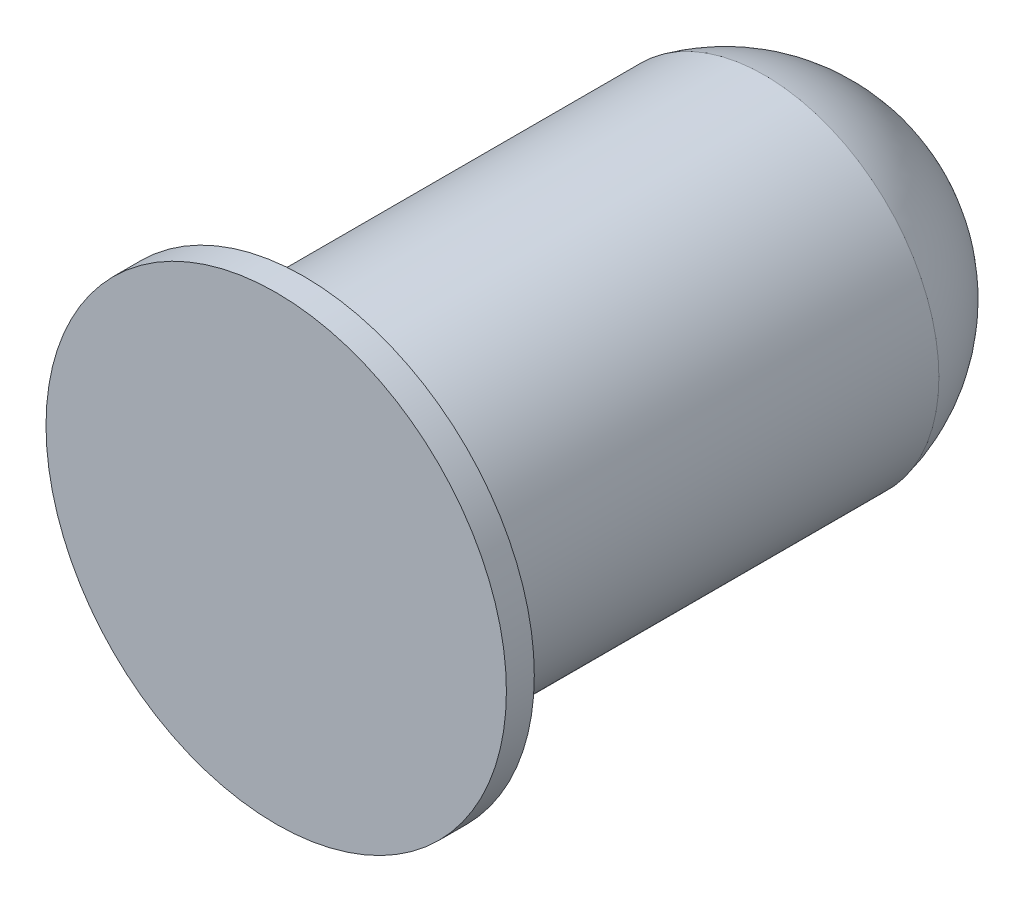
ISO-10303-21;
HEADER;
FILE_DESCRIPTION(('STEP AP214'),'2;1');
FILE_NAME('part.step','',(''),(''),'','','');
FILE_SCHEMA(('AUTOMOTIVE_DESIGN { 1 0 10303 214 1 1 1 1 }'));
ENDSEC;
DATA;
#1=APPLICATION_CONTEXT('core data for automotive mechanical design processes');
#2=APPLICATION_PROTOCOL_DEFINITION('international standard','automotive_design',2000,#1);
#3=PRODUCT_CONTEXT('',#1,'mechanical');
#4=PRODUCT('Part','Part','',(#3));
#5=PRODUCT_RELATED_PRODUCT_CATEGORY('part','',(#4));
#6=PRODUCT_DEFINITION_FORMATION('','',#4);
#7=PRODUCT_DEFINITION_CONTEXT('part definition',#1,'design');
#8=PRODUCT_DEFINITION('design','',#6,#7);
#9=PRODUCT_DEFINITION_SHAPE('','',#8);
#10=(LENGTH_UNIT() NAMED_UNIT(*) SI_UNIT(.MILLI.,.METRE.));
#11=(NAMED_UNIT(*) PLANE_ANGLE_UNIT() SI_UNIT($,.RADIAN.));
#12=(NAMED_UNIT(*) SI_UNIT($,.STERADIAN.) SOLID_ANGLE_UNIT());
#13=UNCERTAINTY_MEASURE_WITH_UNIT(LENGTH_MEASURE(1.E-05),#10,'distance_accuracy_value','');
#14=(GEOMETRIC_REPRESENTATION_CONTEXT(3) GLOBAL_UNCERTAINTY_ASSIGNED_CONTEXT((#13)) GLOBAL_UNIT_ASSIGNED_CONTEXT((#10,
#11,#12)) REPRESENTATION_CONTEXT('',''));
#15=CARTESIAN_POINT('',(0.,0.,0.));
#16=DIRECTION('',(0.,0.,1.));
#17=DIRECTION('',(1.,0.,0.));
#18=AXIS2_PLACEMENT_3D('',#15,#16,#17);
#19=CARTESIAN_POINT('',(0.,0.,4.191));
#20=DIRECTION('',(0.,0.,-1.));
#21=DIRECTION('',(-1.,0.,0.));
#22=AXIS2_PLACEMENT_3D('',#19,#20,#21);
#23=CYLINDRICAL_SURFACE('',#22,1.5875);
#24=CARTESIAN_POINT('',(0.,0.,4.191));
#25=DIRECTION('',(0.,0.,1.));
#26=DIRECTION('',(1.,0.,0.));
#27=AXIS2_PLACEMENT_3D('',#24,#25,#26);
#28=CIRCLE('',#27,1.5875);
#29=CARTESIAN_POINT('',(1.5875,0.,4.191));
#30=VERTEX_POINT('',#29);
#31=EDGE_CURVE('E10',#30,#30,#28,.T.);
#32=ORIENTED_EDGE('',*,*,#31,.F.);
#33=EDGE_LOOP('',(#32));
#34=FACE_BOUND('',#33,.T.);
#35=CARTESIAN_POINT('',(0.,0.,0.));
#36=DIRECTION('',(0.,0.,1.));
#37=DIRECTION('',(1.,0.,0.));
#38=AXIS2_PLACEMENT_3D('',#35,#36,#37);
#39=CIRCLE('',#38,1.5875);
#40=CARTESIAN_POINT('',(1.5875,0.,0.));
#41=VERTEX_POINT('',#40);
#42=EDGE_CURVE('E34',#41,#41,#39,.T.);
#43=ORIENTED_EDGE('',*,*,#42,.T.);
#44=EDGE_LOOP('',(#43));
#45=FACE_BOUND('',#44,.T.);
#46=ADVANCED_FACE('F27',(#34,#45),#23,.T.);
#47=CARTESIAN_POINT('',(0.,0.,0.3571875));
#48=DIRECTION('',(0.,0.,1.));
#49=DIRECTION('',(1.,0.,0.));
#50=AXIS2_PLACEMENT_3D('',#47,#48,#49);
#51=SPHERICAL_SURFACE('',#50,1.6271875);
#52=ORIENTED_EDGE('',*,*,#42,.F.);
#53=EDGE_LOOP('',(#52));
#54=FACE_BOUND('',#53,.T.);
#55=ADVANCED_FACE('F29',(#54),#51,.T.);
#56=CARTESIAN_POINT('',(0.,0.,4.191));
#57=DIRECTION('',(0.,0.,1.));
#58=DIRECTION('',(1.,0.,0.));
#59=AXIS2_PLACEMENT_3D('',#56,#57,#58);
#60=PLANE('',#59);
#61=CARTESIAN_POINT('',(0.,0.,4.191));
#62=DIRECTION('',(0.,0.,1.));
#63=DIRECTION('',(1.,0.,0.));
#64=AXIS2_PLACEMENT_3D('',#61,#62,#63);
#65=CIRCLE('',#64,2.0955);
#66=CARTESIAN_POINT('',(2.0955,0.,4.191));
#67=VERTEX_POINT('',#66);
#68=EDGE_CURVE('E42',#67,#67,#65,.T.);
#69=ORIENTED_EDGE('',*,*,#68,.F.);
#70=EDGE_LOOP('',(#69));
#71=FACE_BOUND('',#70,.T.);
#72=ORIENTED_EDGE('',*,*,#31,.T.);
#73=EDGE_LOOP('',(#72));
#74=FACE_BOUND('',#73,.T.);
#75=ADVANCED_FACE('F50',(#71,#74),#60,.F.);
#76=CARTESIAN_POINT('',(0.,0.,4.445));
#77=DIRECTION('',(0.,0.,-1.));
#78=DIRECTION('',(-1.,0.,0.));
#79=AXIS2_PLACEMENT_3D('',#76,#77,#78);
#80=CYLINDRICAL_SURFACE('',#79,2.0955);
#81=CARTESIAN_POINT('',(0.,0.,4.445));
#82=DIRECTION('',(0.,0.,1.));
#83=DIRECTION('',(1.,0.,0.));
#84=AXIS2_PLACEMENT_3D('',#81,#82,#83);
#85=CIRCLE('',#84,2.0955);
#86=CARTESIAN_POINT('',(2.0955,0.,4.445));
#87=VERTEX_POINT('',#86);
#88=EDGE_CURVE('E38',#87,#87,#85,.T.);
#89=ORIENTED_EDGE('',*,*,#88,.F.);
#90=EDGE_LOOP('',(#89));
#91=FACE_BOUND('',#90,.T.);
#92=ORIENTED_EDGE('',*,*,#68,.T.);
#93=EDGE_LOOP('',(#92));
#94=FACE_BOUND('',#93,.T.);
#95=ADVANCED_FACE('F48',(#91,#94),#80,.T.);
#96=CARTESIAN_POINT('',(0.,0.,4.445));
#97=DIRECTION('',(0.,0.,1.));
#98=DIRECTION('',(1.,0.,0.));
#99=AXIS2_PLACEMENT_3D('',#96,#97,#98);
#100=PLANE('',#99);
#101=ORIENTED_EDGE('',*,*,#88,.T.);
#102=EDGE_LOOP('',(#101));
#103=FACE_BOUND('',#102,.T.);
#104=ADVANCED_FACE('F53',(#103),#100,.T.);
#105=CLOSED_SHELL('',(#46,#55,#75,#95,#104));
#106=MANIFOLD_SOLID_BREP('B2',#105);
#107=ADVANCED_BREP_SHAPE_REPRESENTATION('',(#18,#106),#14);
#108=SHAPE_DEFINITION_REPRESENTATION(#9,#107);
ENDSEC;
END-ISO-10303-21;
